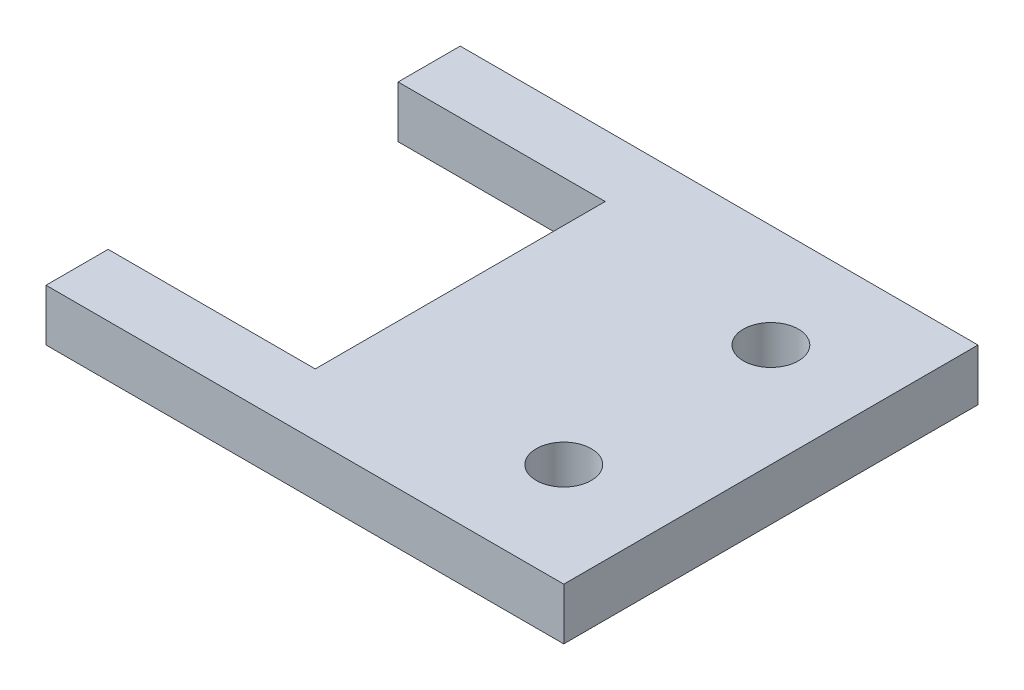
ISO-10303-21;
HEADER;
FILE_DESCRIPTION(('STEP AP214'),'2;1');
FILE_NAME('part.step','',(''),(''),'','','');
FILE_SCHEMA(('AUTOMOTIVE_DESIGN { 1 0 10303 214 1 1 1 1 }'));
ENDSEC;
DATA;
#1=APPLICATION_CONTEXT('core data for automotive mechanical design processes');
#2=APPLICATION_PROTOCOL_DEFINITION('international standard','automotive_design',2000,#1);
#3=PRODUCT_CONTEXT('',#1,'mechanical');
#4=PRODUCT('Part','Part','',(#3));
#5=PRODUCT_RELATED_PRODUCT_CATEGORY('part','',(#4));
#6=PRODUCT_DEFINITION_FORMATION('','',#4);
#7=PRODUCT_DEFINITION_CONTEXT('part definition',#1,'design');
#8=PRODUCT_DEFINITION('design','',#6,#7);
#9=PRODUCT_DEFINITION_SHAPE('','',#8);
#10=(LENGTH_UNIT() NAMED_UNIT(*) SI_UNIT(.MILLI.,.METRE.));
#11=(NAMED_UNIT(*) PLANE_ANGLE_UNIT() SI_UNIT($,.RADIAN.));
#12=(NAMED_UNIT(*) SI_UNIT($,.STERADIAN.) SOLID_ANGLE_UNIT());
#13=UNCERTAINTY_MEASURE_WITH_UNIT(LENGTH_MEASURE(1.E-05),#10,'distance_accuracy_value','');
#14=(GEOMETRIC_REPRESENTATION_CONTEXT(3) GLOBAL_UNCERTAINTY_ASSIGNED_CONTEXT((#13)) GLOBAL_UNIT_ASSIGNED_CONTEXT((#10,
#11,#12)) REPRESENTATION_CONTEXT('',''));
#15=CARTESIAN_POINT('',(0.,0.,0.));
#16=DIRECTION('',(0.,0.,1.));
#17=DIRECTION('',(1.,0.,0.));
#18=AXIS2_PLACEMENT_3D('',#15,#16,#17);
#19=CARTESIAN_POINT('',(-54.5504290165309,6.35,-25.0465004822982));
#20=DIRECTION('',(1.,0.,0.));
#21=DIRECTION('',(0.,0.,-1.));
#22=AXIS2_PLACEMENT_3D('',#19,#20,#21);
#23=PLANE('',#22);
#24=DIRECTION('',(0.,0.,1.));
#25=VECTOR('',#24,1.);
#26=CARTESIAN_POINT('',(-54.5504290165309,0.,-25.0465004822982));
#27=LINE('',#26,#25);
#28=CARTESIAN_POINT('',(-54.5504290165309,0.,-25.0465004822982));
#29=VERTEX_POINT('',#28);
#30=CARTESIAN_POINT('',(-54.5504290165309,0.,-17.4265004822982));
#31=VERTEX_POINT('',#30);
#32=EDGE_CURVE('E140',#29,#31,#27,.T.);
#33=ORIENTED_EDGE('',*,*,#32,.T.);
#34=DIRECTION('',(0.,1.,0.));
#35=VECTOR('',#34,1.);
#36=CARTESIAN_POINT('',(-54.5504290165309,0.,-17.4265004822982));
#37=LINE('',#36,#35);
#38=CARTESIAN_POINT('',(-54.5504290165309,6.35,-17.4265004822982));
#39=VERTEX_POINT('',#38);
#40=EDGE_CURVE('E141',#31,#39,#37,.T.);
#41=ORIENTED_EDGE('',*,*,#40,.T.);
#42=DIRECTION('',(0.,0.,1.));
#43=VECTOR('',#42,1.);
#44=CARTESIAN_POINT('',(-54.5504290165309,6.35,-25.0465004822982));
#45=LINE('',#44,#43);
#46=CARTESIAN_POINT('',(-54.5504290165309,6.35,-25.0465004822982));
#47=VERTEX_POINT('',#46);
#48=EDGE_CURVE('E182',#47,#39,#45,.T.);
#49=ORIENTED_EDGE('',*,*,#48,.F.);
#50=DIRECTION('',(0.,-1.,0.));
#51=VECTOR('',#50,1.);
#52=CARTESIAN_POINT('',(-54.5504290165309,6.35,-25.0465004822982));
#53=LINE('',#52,#51);
#54=EDGE_CURVE('E161',#47,#29,#53,.T.);
#55=ORIENTED_EDGE('',*,*,#54,.T.);
#56=EDGE_LOOP('',(#33,#41,#49,#55));
#57=FACE_BOUND('',#56,.T.);
#58=ADVANCED_FACE('F43',(#57),#23,.F.);
#59=CARTESIAN_POINT('',(-54.5504290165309,6.35,18.1334995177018));
#60=VERTEX_POINT('',#59);
#61=CARTESIAN_POINT('',(-54.5504290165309,6.35,25.7534995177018));
#62=VERTEX_POINT('',#61);
#63=EDGE_CURVE('E96',#60,#62,#45,.T.);
#64=ORIENTED_EDGE('',*,*,#63,.F.);
#65=DIRECTION('',(0.,1.,0.));
#66=VECTOR('',#65,1.);
#67=CARTESIAN_POINT('',(-54.5504290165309,0.,18.1334995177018));
#68=LINE('',#67,#66);
#69=CARTESIAN_POINT('',(-54.5504290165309,0.,18.1334995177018));
#70=VERTEX_POINT('',#69);
#71=EDGE_CURVE('E122',#70,#60,#68,.T.);
#72=ORIENTED_EDGE('',*,*,#71,.F.);
#73=CARTESIAN_POINT('',(-54.5504290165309,0.,25.7534995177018));
#74=VERTEX_POINT('',#73);
#75=EDGE_CURVE('E131',#70,#74,#27,.T.);
#76=ORIENTED_EDGE('',*,*,#75,.T.);
#77=DIRECTION('',(0.,-1.,0.));
#78=VECTOR('',#77,1.);
#79=CARTESIAN_POINT('',(-54.5504290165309,6.35,25.7534995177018));
#80=LINE('',#79,#78);
#81=EDGE_CURVE('E11',#62,#74,#80,.T.);
#82=ORIENTED_EDGE('',*,*,#81,.F.);
#83=EDGE_LOOP('',(#64,#72,#76,#82));
#84=FACE_BOUND('',#83,.T.);
#85=ADVANCED_FACE('F45',(#84),#23,.F.);
#86=CARTESIAN_POINT('',(-54.5504290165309,6.35,25.7534995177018));
#87=DIRECTION('',(0.,0.,-1.));
#88=DIRECTION('',(-1.,0.,0.));
#89=AXIS2_PLACEMENT_3D('',#86,#87,#88);
#90=PLANE('',#89);
#91=DIRECTION('',(1.,0.,0.));
#92=VECTOR('',#91,1.);
#93=CARTESIAN_POINT('',(-54.5504290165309,0.,25.7534995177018));
#94=LINE('',#93,#92);
#95=CARTESIAN_POINT('',(8.9495709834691,0.,25.7534995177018));
#96=VERTEX_POINT('',#95);
#97=EDGE_CURVE('E138',#74,#96,#94,.T.);
#98=ORIENTED_EDGE('',*,*,#97,.T.);
#99=DIRECTION('',(0.,-1.,0.));
#100=VECTOR('',#99,1.);
#101=CARTESIAN_POINT('',(8.9495709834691,6.35,25.7534995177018));
#102=LINE('',#101,#100);
#103=CARTESIAN_POINT('',(8.9495709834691,6.35,25.7534995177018));
#104=VERTEX_POINT('',#103);
#105=EDGE_CURVE('E52',#104,#96,#102,.T.);
#106=ORIENTED_EDGE('',*,*,#105,.F.);
#107=DIRECTION('',(1.,0.,0.));
#108=VECTOR('',#107,1.);
#109=CARTESIAN_POINT('',(-54.5504290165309,6.35,25.7534995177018));
#110=LINE('',#109,#108);
#111=EDGE_CURVE('E188',#62,#104,#110,.T.);
#112=ORIENTED_EDGE('',*,*,#111,.F.);
#113=ORIENTED_EDGE('',*,*,#81,.T.);
#114=EDGE_LOOP('',(#98,#106,#112,#113));
#115=FACE_BOUND('',#114,.T.);
#116=ADVANCED_FACE('F257',(#115),#90,.F.);
#117=CARTESIAN_POINT('',(8.9495709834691,6.35,-25.0465004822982));
#118=DIRECTION('',(-1.,0.,0.));
#119=DIRECTION('',(0.,0.,1.));
#120=AXIS2_PLACEMENT_3D('',#117,#118,#119);
#121=PLANE('',#120);
#122=DIRECTION('',(0.,0.,-1.));
#123=VECTOR('',#122,1.);
#124=CARTESIAN_POINT('',(8.9495709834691,0.,-25.0465004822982));
#125=LINE('',#124,#123);
#126=CARTESIAN_POINT('',(8.9495709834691,0.,-25.0465004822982));
#127=VERTEX_POINT('',#126);
#128=EDGE_CURVE('E156',#96,#127,#125,.T.);
#129=ORIENTED_EDGE('',*,*,#128,.T.);
#130=DIRECTION('',(0.,-1.,0.));
#131=VECTOR('',#130,1.);
#132=CARTESIAN_POINT('',(8.9495709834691,6.35,-25.0465004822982));
#133=LINE('',#132,#131);
#134=CARTESIAN_POINT('',(8.9495709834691,6.35,-25.0465004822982));
#135=VERTEX_POINT('',#134);
#136=EDGE_CURVE('E164',#135,#127,#133,.T.);
#137=ORIENTED_EDGE('',*,*,#136,.F.);
#138=DIRECTION('',(0.,0.,-1.));
#139=VECTOR('',#138,1.);
#140=CARTESIAN_POINT('',(8.9495709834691,6.35,-25.0465004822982));
#141=LINE('',#140,#139);
#142=EDGE_CURVE('E175',#104,#135,#141,.T.);
#143=ORIENTED_EDGE('',*,*,#142,.F.);
#144=ORIENTED_EDGE('',*,*,#105,.T.);
#145=EDGE_LOOP('',(#129,#137,#143,#144));
#146=FACE_BOUND('',#145,.T.);
#147=ADVANCED_FACE('F173',(#146),#121,.F.);
#148=CARTESIAN_POINT('',(-54.5504290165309,6.35,-25.0465004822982));
#149=DIRECTION('',(0.,0.,1.));
#150=DIRECTION('',(1.,0.,0.));
#151=AXIS2_PLACEMENT_3D('',#148,#149,#150);
#152=PLANE('',#151);
#153=DIRECTION('',(-1.,0.,0.));
#154=VECTOR('',#153,1.);
#155=CARTESIAN_POINT('',(-54.5504290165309,0.,-25.0465004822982));
#156=LINE('',#155,#154);
#157=EDGE_CURVE('E89',#127,#29,#156,.T.);
#158=ORIENTED_EDGE('',*,*,#157,.T.);
#159=ORIENTED_EDGE('',*,*,#54,.F.);
#160=DIRECTION('',(-1.,0.,0.));
#161=VECTOR('',#160,1.);
#162=CARTESIAN_POINT('',(-54.5504290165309,6.35,-25.0465004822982));
#163=LINE('',#162,#161);
#164=EDGE_CURVE('E68',#135,#47,#163,.T.);
#165=ORIENTED_EDGE('',*,*,#164,.F.);
#166=ORIENTED_EDGE('',*,*,#136,.T.);
#167=EDGE_LOOP('',(#158,#159,#165,#166));
#168=FACE_BOUND('',#167,.T.);
#169=ADVANCED_FACE('F183',(#168),#152,.F.);
#170=CARTESIAN_POINT('',(0.,6.35,0.));
#171=DIRECTION('',(0.,1.,0.));
#172=DIRECTION('',(0.,0.,1.));
#173=AXIS2_PLACEMENT_3D('',#170,#171,#172);
#174=PLANE('',#173);
#175=CARTESIAN_POINT('',(-3.7504290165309,6.35,-12.3465004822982));
#176=DIRECTION('',(0.,1.,0.));
#177=DIRECTION('',(0.,0.,1.));
#178=AXIS2_PLACEMENT_3D('',#175,#176,#177);
#179=CIRCLE('',#178,3.37819999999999);
#180=CARTESIAN_POINT('',(-3.7504290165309,6.35,-8.96830048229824));
#181=VERTEX_POINT('',#180);
#182=EDGE_CURVE('E225',#181,#181,#179,.T.);
#183=ORIENTED_EDGE('',*,*,#182,.F.);
#184=EDGE_LOOP('',(#183));
#185=FACE_BOUND('',#184,.T.);
#186=CARTESIAN_POINT('',(-3.7504290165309,6.35,13.0534995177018));
#187=DIRECTION('',(0.,1.,0.));
#188=DIRECTION('',(0.,0.,1.));
#189=AXIS2_PLACEMENT_3D('',#186,#187,#188);
#190=CIRCLE('',#189,3.37819999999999);
#191=CARTESIAN_POINT('',(-3.7504290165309,6.35,16.4316995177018));
#192=VERTEX_POINT('',#191);
#193=EDGE_CURVE('E217',#192,#192,#190,.T.);
#194=ORIENTED_EDGE('',*,*,#193,.F.);
#195=EDGE_LOOP('',(#194));
#196=FACE_BOUND('',#195,.T.);
#197=DIRECTION('',(-1.,0.,0.));
#198=VECTOR('',#197,1.);
#199=CARTESIAN_POINT('',(-54.5504290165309,6.35,-17.4265004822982));
#200=LINE('',#199,#198);
#201=CARTESIAN_POINT('',(-29.1504290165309,6.35,-17.4265004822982));
#202=VERTEX_POINT('',#201);
#203=EDGE_CURVE('E127',#202,#39,#200,.T.);
#204=ORIENTED_EDGE('',*,*,#203,.F.);
#205=DIRECTION('',(0.,0.,-1.));
#206=VECTOR('',#205,1.);
#207=CARTESIAN_POINT('',(-29.1504290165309,6.35,-17.4265004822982));
#208=LINE('',#207,#206);
#209=CARTESIAN_POINT('',(-29.1504290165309,6.35,18.1334995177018));
#210=VERTEX_POINT('',#209);
#211=EDGE_CURVE('E202',#210,#202,#208,.T.);
#212=ORIENTED_EDGE('',*,*,#211,.F.);
#213=DIRECTION('',(1.,0.,0.));
#214=VECTOR('',#213,1.);
#215=CARTESIAN_POINT('',(-54.5504290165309,6.35,18.1334995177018));
#216=LINE('',#215,#214);
#217=EDGE_CURVE('E206',#60,#210,#216,.T.);
#218=ORIENTED_EDGE('',*,*,#217,.F.);
#219=ORIENTED_EDGE('',*,*,#63,.T.);
#220=ORIENTED_EDGE('',*,*,#111,.T.);
#221=ORIENTED_EDGE('',*,*,#142,.T.);
#222=ORIENTED_EDGE('',*,*,#164,.T.);
#223=ORIENTED_EDGE('',*,*,#48,.T.);
#224=EDGE_LOOP('',(#204,#212,#218,#219,#220,#221,#222,#223));
#225=FACE_BOUND('',#224,.T.);
#226=ADVANCED_FACE('F234',(#185,#196,#225),#174,.T.);
#227=CARTESIAN_POINT('',(0.,0.,0.));
#228=DIRECTION('',(0.,1.,0.));
#229=DIRECTION('',(0.,0.,1.));
#230=AXIS2_PLACEMENT_3D('',#227,#228,#229);
#231=PLANE('',#230);
#232=CARTESIAN_POINT('',(-3.7504290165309,0.,-12.3465004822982));
#233=DIRECTION('',(0.,1.,0.));
#234=DIRECTION('',(0.,0.,1.));
#235=AXIS2_PLACEMENT_3D('',#232,#233,#234);
#236=CIRCLE('',#235,3.37819999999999);
#237=CARTESIAN_POINT('',(-3.7504290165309,0.,-8.96830048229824));
#238=VERTEX_POINT('',#237);
#239=EDGE_CURVE('E221',#238,#238,#236,.T.);
#240=ORIENTED_EDGE('',*,*,#239,.T.);
#241=EDGE_LOOP('',(#240));
#242=FACE_BOUND('',#241,.T.);
#243=CARTESIAN_POINT('',(-3.7504290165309,0.,13.0534995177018));
#244=DIRECTION('',(0.,1.,0.));
#245=DIRECTION('',(0.,0.,1.));
#246=AXIS2_PLACEMENT_3D('',#243,#244,#245);
#247=CIRCLE('',#246,3.37819999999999);
#248=CARTESIAN_POINT('',(-3.7504290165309,0.,16.4316995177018));
#249=VERTEX_POINT('',#248);
#250=EDGE_CURVE('E209',#249,#249,#247,.T.);
#251=ORIENTED_EDGE('',*,*,#250,.T.);
#252=EDGE_LOOP('',(#251));
#253=FACE_BOUND('',#252,.T.);
#254=DIRECTION('',(0.,0.,-1.));
#255=VECTOR('',#254,1.);
#256=CARTESIAN_POINT('',(-29.1504290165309,0.,-17.4265004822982));
#257=LINE('',#256,#255);
#258=CARTESIAN_POINT('',(-29.1504290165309,0.,18.1334995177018));
#259=VERTEX_POINT('',#258);
#260=CARTESIAN_POINT('',(-29.1504290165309,0.,-17.4265004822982));
#261=VERTEX_POINT('',#260);
#262=EDGE_CURVE('E59',#259,#261,#257,.T.);
#263=ORIENTED_EDGE('',*,*,#262,.T.);
#264=DIRECTION('',(-1.,0.,0.));
#265=VECTOR('',#264,1.);
#266=CARTESIAN_POINT('',(-54.5504290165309,0.,-17.4265004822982));
#267=LINE('',#266,#265);
#268=EDGE_CURVE('E134',#261,#31,#267,.T.);
#269=ORIENTED_EDGE('',*,*,#268,.T.);
#270=ORIENTED_EDGE('',*,*,#32,.F.);
#271=ORIENTED_EDGE('',*,*,#157,.F.);
#272=ORIENTED_EDGE('',*,*,#128,.F.);
#273=ORIENTED_EDGE('',*,*,#97,.F.);
#274=ORIENTED_EDGE('',*,*,#75,.F.);
#275=DIRECTION('',(1.,0.,0.));
#276=VECTOR('',#275,1.);
#277=CARTESIAN_POINT('',(-54.5504290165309,0.,18.1334995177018));
#278=LINE('',#277,#276);
#279=EDGE_CURVE('E118',#70,#259,#278,.T.);
#280=ORIENTED_EDGE('',*,*,#279,.T.);
#281=EDGE_LOOP('',(#263,#269,#270,#271,#272,#273,#274,#280));
#282=FACE_BOUND('',#281,.T.);
#283=ADVANCED_FACE('F136',(#242,#253,#282),#231,.F.);
#284=CARTESIAN_POINT('',(-54.5504290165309,0.,-17.4265004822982));
#285=DIRECTION('',(0.,0.,-1.));
#286=DIRECTION('',(-1.,0.,0.));
#287=AXIS2_PLACEMENT_3D('',#284,#285,#286);
#288=PLANE('',#287);
#289=ORIENTED_EDGE('',*,*,#203,.T.);
#290=ORIENTED_EDGE('',*,*,#40,.F.);
#291=ORIENTED_EDGE('',*,*,#268,.F.);
#292=DIRECTION('',(0.,1.,0.));
#293=VECTOR('',#292,1.);
#294=CARTESIAN_POINT('',(-29.1504290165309,0.,-17.4265004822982));
#295=LINE('',#294,#293);
#296=EDGE_CURVE('E149',#261,#202,#295,.T.);
#297=ORIENTED_EDGE('',*,*,#296,.T.);
#298=EDGE_LOOP('',(#289,#290,#291,#297));
#299=FACE_BOUND('',#298,.T.);
#300=ADVANCED_FACE('F242',(#299),#288,.F.);
#301=CARTESIAN_POINT('',(-29.1504290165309,0.,-17.4265004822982));
#302=DIRECTION('',(1.,0.,0.));
#303=DIRECTION('',(0.,0.,-1.));
#304=AXIS2_PLACEMENT_3D('',#301,#302,#303);
#305=PLANE('',#304);
#306=ORIENTED_EDGE('',*,*,#211,.T.);
#307=ORIENTED_EDGE('',*,*,#296,.F.);
#308=ORIENTED_EDGE('',*,*,#262,.F.);
#309=DIRECTION('',(0.,1.,0.));
#310=VECTOR('',#309,1.);
#311=CARTESIAN_POINT('',(-29.1504290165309,0.,18.1334995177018));
#312=LINE('',#311,#310);
#313=EDGE_CURVE('E123',#259,#210,#312,.T.);
#314=ORIENTED_EDGE('',*,*,#313,.T.);
#315=EDGE_LOOP('',(#306,#307,#308,#314));
#316=FACE_BOUND('',#315,.T.);
#317=ADVANCED_FACE('F243',(#316),#305,.F.);
#318=CARTESIAN_POINT('',(-54.5504290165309,0.,18.1334995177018));
#319=DIRECTION('',(0.,0.,1.));
#320=DIRECTION('',(1.,0.,0.));
#321=AXIS2_PLACEMENT_3D('',#318,#319,#320);
#322=PLANE('',#321);
#323=ORIENTED_EDGE('',*,*,#217,.T.);
#324=ORIENTED_EDGE('',*,*,#313,.F.);
#325=ORIENTED_EDGE('',*,*,#279,.F.);
#326=ORIENTED_EDGE('',*,*,#71,.T.);
#327=EDGE_LOOP('',(#323,#324,#325,#326));
#328=FACE_BOUND('',#327,.T.);
#329=ADVANCED_FACE('F121',(#328),#322,.F.);
#330=CARTESIAN_POINT('',(-3.7504290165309,6.35,13.0534995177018));
#331=DIRECTION('',(0.,1.,0.));
#332=DIRECTION('',(0.,0.,1.));
#333=AXIS2_PLACEMENT_3D('',#330,#331,#332);
#334=CYLINDRICAL_SURFACE('',#333,3.37819999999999);
#335=ORIENTED_EDGE('',*,*,#250,.F.);
#336=EDGE_LOOP('',(#335));
#337=FACE_BOUND('',#336,.T.);
#338=ORIENTED_EDGE('',*,*,#193,.T.);
#339=EDGE_LOOP('',(#338));
#340=FACE_BOUND('',#339,.T.);
#341=ADVANCED_FACE('F250',(#337,#340),#334,.F.);
#342=CARTESIAN_POINT('',(-3.7504290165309,6.35,-12.3465004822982));
#343=DIRECTION('',(0.,1.,0.));
#344=DIRECTION('',(0.,0.,1.));
#345=AXIS2_PLACEMENT_3D('',#342,#343,#344);
#346=CYLINDRICAL_SURFACE('',#345,3.37819999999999);
#347=ORIENTED_EDGE('',*,*,#239,.F.);
#348=EDGE_LOOP('',(#347));
#349=FACE_BOUND('',#348,.T.);
#350=ORIENTED_EDGE('',*,*,#182,.T.);
#351=EDGE_LOOP('',(#350));
#352=FACE_BOUND('',#351,.T.);
#353=ADVANCED_FACE('F232',(#349,#352),#346,.F.);
#354=CLOSED_SHELL('',(#58,#85,#116,#147,#169,#226,#283,#300,#317,#329,#341,#353));
#355=MANIFOLD_SOLID_BREP('B2',#354);
#356=ADVANCED_BREP_SHAPE_REPRESENTATION('',(#18,#355),#14);
#357=SHAPE_DEFINITION_REPRESENTATION(#9,#356);
ENDSEC;
END-ISO-10303-21;
